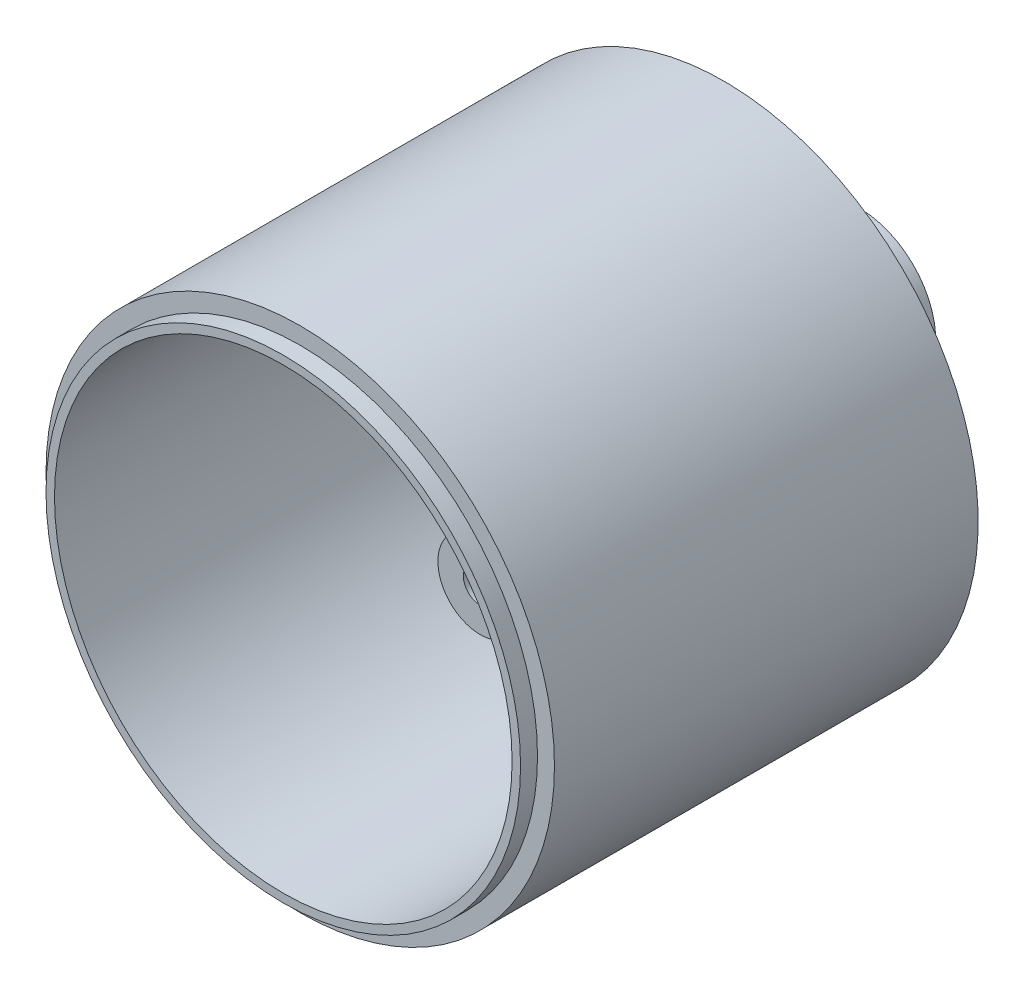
ISO-10303-21;
HEADER;
FILE_DESCRIPTION(('STEP AP214'),'2;1');
FILE_NAME('part.step','',(''),(''),'','','');
FILE_SCHEMA(('AUTOMOTIVE_DESIGN { 1 0 10303 214 1 1 1 1 }'));
ENDSEC;
DATA;
#1=APPLICATION_CONTEXT('core data for automotive mechanical design processes');
#2=APPLICATION_PROTOCOL_DEFINITION('international standard','automotive_design',2000,#1);
#3=PRODUCT_CONTEXT('',#1,'mechanical');
#4=PRODUCT('Part','Part','',(#3));
#5=PRODUCT_RELATED_PRODUCT_CATEGORY('part','',(#4));
#6=PRODUCT_DEFINITION_FORMATION('','',#4);
#7=PRODUCT_DEFINITION_CONTEXT('part definition',#1,'design');
#8=PRODUCT_DEFINITION('design','',#6,#7);
#9=PRODUCT_DEFINITION_SHAPE('','',#8);
#10=(LENGTH_UNIT() NAMED_UNIT(*) SI_UNIT(.MILLI.,.METRE.));
#11=(NAMED_UNIT(*) PLANE_ANGLE_UNIT() SI_UNIT($,.RADIAN.));
#12=(NAMED_UNIT(*) SI_UNIT($,.STERADIAN.) SOLID_ANGLE_UNIT());
#13=UNCERTAINTY_MEASURE_WITH_UNIT(LENGTH_MEASURE(1.E-05),#10,'distance_accuracy_value','');
#14=(GEOMETRIC_REPRESENTATION_CONTEXT(3) GLOBAL_UNCERTAINTY_ASSIGNED_CONTEXT((#13)) GLOBAL_UNIT_ASSIGNED_CONTEXT((#10,
#11,#12)) REPRESENTATION_CONTEXT('',''));
#15=CARTESIAN_POINT('',(0.,0.,0.));
#16=DIRECTION('',(0.,0.,1.));
#17=DIRECTION('',(1.,0.,0.));
#18=AXIS2_PLACEMENT_3D('',#15,#16,#17);
#19=CARTESIAN_POINT('',(-3.375,-6.97652313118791,-11.25));
#20=DIRECTION('',(0.,0.,1.));
#21=DIRECTION('',(1.,0.,0.));
#22=AXIS2_PLACEMENT_3D('',#19,#20,#21);
#23=PLANE('',#22);
#24=CARTESIAN_POINT('',(-3.375,-6.97652313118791,-11.25));
#25=DIRECTION('',(0.,0.,1.));
#26=DIRECTION('',(1.,0.,0.));
#27=AXIS2_PLACEMENT_3D('',#24,#25,#26);
#28=CIRCLE('',#27,1.);
#29=CARTESIAN_POINT('',(-2.375,-6.97652313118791,-11.25));
#30=VERTEX_POINT('',#29);
#31=EDGE_CURVE('E117',#30,#30,#28,.T.);
#32=ORIENTED_EDGE('',*,*,#31,.F.);
#33=EDGE_LOOP('',(#32));
#34=FACE_BOUND('',#33,.T.);
#35=CARTESIAN_POINT('',(-3.375,-6.97652313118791,-11.25));
#36=DIRECTION('',(0.,0.,1.));
#37=DIRECTION('',(1.,0.,0.));
#38=AXIS2_PLACEMENT_3D('',#35,#36,#37);
#39=CIRCLE('',#38,2.5);
#40=CARTESIAN_POINT('',(-3.9253017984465,-4.53784153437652,-11.25));
#41=VERTEX_POINT('',#40);
#42=CARTESIAN_POINT('',(-1.12139435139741,-5.89427473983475,-11.25));
#43=VERTEX_POINT('',#42);
#44=EDGE_CURVE('E85',#41,#43,#39,.T.);
#45=ORIENTED_EDGE('',*,*,#44,.T.);
#46=CARTESIAN_POINT('',(0.,0.,-11.25));
#47=DIRECTION('',(0.,0.,1.));
#48=DIRECTION('',(1.,0.,0.));
#49=AXIS2_PLACEMENT_3D('',#46,#47,#48);
#50=CIRCLE('',#49,6.);
#51=EDGE_CURVE('E86',#43,#41,#50,.F.);
#52=ORIENTED_EDGE('',*,*,#51,.T.);
#53=EDGE_LOOP('',(#45,#52));
#54=FACE_BOUND('',#53,.T.);
#55=ADVANCED_FACE('F33',(#34,#54),#23,.T.);
#56=CARTESIAN_POINT('',(-3.375,-6.97652313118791,-11.25));
#57=DIRECTION('',(0.,0.,-1.));
#58=DIRECTION('',(-1.,0.,0.));
#59=AXIS2_PLACEMENT_3D('',#56,#57,#58);
#60=CYLINDRICAL_SURFACE('',#59,2.5);
#61=DIRECTION('',(0.,0.,-1.));
#62=VECTOR('',#61,1.);
#63=CARTESIAN_POINT('',(-1.12139435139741,-5.89427473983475,-8.5));
#64=LINE('',#63,#62);
#65=CARTESIAN_POINT('',(-1.12139435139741,-5.89427473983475,-20.75));
#66=VERTEX_POINT('',#65);
#67=EDGE_CURVE('E76',#43,#66,#64,.T.);
#68=ORIENTED_EDGE('',*,*,#67,.F.);
#69=ORIENTED_EDGE('',*,*,#44,.F.);
#70=DIRECTION('',(0.,0.,-1.));
#71=VECTOR('',#70,1.);
#72=CARTESIAN_POINT('',(-3.9253017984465,-4.53784153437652,-8.5));
#73=LINE('',#72,#71);
#74=CARTESIAN_POINT('',(-3.9253017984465,-4.53784153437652,-20.75));
#75=VERTEX_POINT('',#74);
#76=EDGE_CURVE('E73',#75,#41,#73,.F.);
#77=ORIENTED_EDGE('',*,*,#76,.F.);
#78=CARTESIAN_POINT('',(-3.375,-6.97652313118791,-20.75));
#79=DIRECTION('',(0.,0.,-1.));
#80=DIRECTION('',(-1.,0.,0.));
#81=AXIS2_PLACEMENT_3D('',#78,#79,#80);
#82=CIRCLE('',#81,2.5);
#83=EDGE_CURVE('E83',#75,#66,#82,.F.);
#84=ORIENTED_EDGE('',*,*,#83,.T.);
#85=EDGE_LOOP('',(#68,#69,#77,#84));
#86=FACE_BOUND('',#85,.T.);
#87=ADVANCED_FACE('F82',(#86),#60,.T.);
#88=CARTESIAN_POINT('',(3.36921506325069,-7.25592102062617,-17.75));
#89=DIRECTION('',(0.,0.,1.));
#90=DIRECTION('',(1.,0.,0.));
#91=AXIS2_PLACEMENT_3D('',#88,#89,#90);
#92=PLANE('',#91);
#93=CARTESIAN_POINT('',(3.36921506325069,-7.25592102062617,-17.75));
#94=DIRECTION('',(0.,0.,1.));
#95=DIRECTION('',(1.,0.,0.));
#96=AXIS2_PLACEMENT_3D('',#93,#94,#95);
#97=CIRCLE('',#96,1.);
#98=CARTESIAN_POINT('',(4.36921506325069,-7.25592102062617,-17.75));
#99=VERTEX_POINT('',#98);
#100=EDGE_CURVE('E114',#99,#99,#97,.T.);
#101=ORIENTED_EDGE('',*,*,#100,.F.);
#102=EDGE_LOOP('',(#101));
#103=FACE_BOUND('',#102,.T.);
#104=CARTESIAN_POINT('',(3.36921506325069,-7.25592102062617,-17.75));
#105=DIRECTION('',(0.,0.,1.));
#106=DIRECTION('',(1.,0.,0.));
#107=AXIS2_PLACEMENT_3D('',#104,#105,#106);
#108=CIRCLE('',#107,2.5);
#109=CARTESIAN_POINT('',(1.29639602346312,-5.85827255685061,-17.75));
#110=VERTEX_POINT('',#109);
#111=CARTESIAN_POINT('',(3.6389776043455,-4.77051800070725,-17.75));
#112=VERTEX_POINT('',#111);
#113=EDGE_CURVE('E110',#110,#112,#108,.T.);
#114=ORIENTED_EDGE('',*,*,#113,.T.);
#115=CARTESIAN_POINT('',(0.,0.,-17.75));
#116=DIRECTION('',(0.,0.,1.));
#117=DIRECTION('',(1.,0.,0.));
#118=AXIS2_PLACEMENT_3D('',#115,#116,#117);
#119=CIRCLE('',#118,6.);
#120=EDGE_CURVE('E78',#112,#110,#119,.F.);
#121=ORIENTED_EDGE('',*,*,#120,.T.);
#122=EDGE_LOOP('',(#114,#121));
#123=FACE_BOUND('',#122,.T.);
#124=ADVANCED_FACE('F109',(#103,#123),#92,.T.);
#125=CARTESIAN_POINT('',(3.36921506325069,-7.25592102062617,-17.75));
#126=DIRECTION('',(0.,0.,-1.));
#127=DIRECTION('',(-1.,0.,0.));
#128=AXIS2_PLACEMENT_3D('',#125,#126,#127);
#129=CYLINDRICAL_SURFACE('',#128,2.5);
#130=DIRECTION('',(0.,0.,-1.));
#131=VECTOR('',#130,1.);
#132=CARTESIAN_POINT('',(3.6389776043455,-4.77051800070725,-8.5));
#133=LINE('',#132,#131);
#134=CARTESIAN_POINT('',(3.6389776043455,-4.77051800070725,-20.75));
#135=VERTEX_POINT('',#134);
#136=EDGE_CURVE('E11',#112,#135,#133,.T.);
#137=ORIENTED_EDGE('',*,*,#136,.F.);
#138=ORIENTED_EDGE('',*,*,#113,.F.);
#139=DIRECTION('',(0.,0.,-1.));
#140=VECTOR('',#139,1.);
#141=CARTESIAN_POINT('',(1.29639602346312,-5.85827255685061,-8.5));
#142=LINE('',#141,#140);
#143=CARTESIAN_POINT('',(1.29639602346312,-5.85827255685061,-20.75));
#144=VERTEX_POINT('',#143);
#145=EDGE_CURVE('E41',#144,#110,#142,.F.);
#146=ORIENTED_EDGE('',*,*,#145,.F.);
#147=CARTESIAN_POINT('',(3.36921506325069,-7.25592102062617,-20.75));
#148=DIRECTION('',(0.,0.,-1.));
#149=DIRECTION('',(-1.,0.,0.));
#150=AXIS2_PLACEMENT_3D('',#147,#148,#149);
#151=CIRCLE('',#150,2.5);
#152=EDGE_CURVE('E90',#144,#135,#151,.F.);
#153=ORIENTED_EDGE('',*,*,#152,.T.);
#154=EDGE_LOOP('',(#137,#138,#146,#153));
#155=FACE_BOUND('',#154,.T.);
#156=ADVANCED_FACE('F112',(#155),#129,.T.);
#157=CARTESIAN_POINT('',(0.,0.,2.75));
#158=DIRECTION('',(0.,0.,1.));
#159=DIRECTION('',(1.,0.,0.));
#160=AXIS2_PLACEMENT_3D('',#157,#158,#159);
#161=PLANE('',#160);
#162=CARTESIAN_POINT('',(0.,0.,2.75));
#163=DIRECTION('',(0.,0.,1.));
#164=DIRECTION('',(1.,0.,0.));
#165=AXIS2_PLACEMENT_3D('',#162,#163,#164);
#166=CIRCLE('',#165,15.);
#167=CARTESIAN_POINT('',(15.,0.,2.75));
#168=VERTEX_POINT('',#167);
#169=EDGE_CURVE('E91',#168,#168,#166,.T.);
#170=ORIENTED_EDGE('',*,*,#169,.T.);
#171=EDGE_LOOP('',(#170));
#172=FACE_BOUND('',#171,.T.);
#173=CARTESIAN_POINT('',(0.,0.,2.75));
#174=DIRECTION('',(0.,0.,1.));
#175=DIRECTION('',(1.,0.,0.));
#176=AXIS2_PLACEMENT_3D('',#173,#174,#175);
#177=CIRCLE('',#176,14.);
#178=CARTESIAN_POINT('',(14.,0.,2.75));
#179=VERTEX_POINT('',#178);
#180=EDGE_CURVE('E238',#179,#179,#177,.T.);
#181=ORIENTED_EDGE('',*,*,#180,.F.);
#182=EDGE_LOOP('',(#181));
#183=FACE_BOUND('',#182,.T.);
#184=ADVANCED_FACE('F228',(#172,#183),#161,.T.);
#185=CARTESIAN_POINT('',(0.,0.,-20.75));
#186=DIRECTION('',(0.,0.,-1.));
#187=DIRECTION('',(-1.,0.,0.));
#188=AXIS2_PLACEMENT_3D('',#185,#186,#187);
#189=PLANE('',#188);
#190=ORIENTED_EDGE('',*,*,#152,.F.);
#191=CARTESIAN_POINT('',(0.,0.,-20.75));
#192=DIRECTION('',(0.,0.,1.));
#193=DIRECTION('',(1.,0.,0.));
#194=AXIS2_PLACEMENT_3D('',#191,#192,#193);
#195=CIRCLE('',#194,6.);
#196=EDGE_CURVE('E54',#144,#135,#195,.T.);
#197=ORIENTED_EDGE('',*,*,#196,.T.);
#198=EDGE_LOOP('',(#190,#197));
#199=FACE_BOUND('',#198,.T.);
#200=CARTESIAN_POINT('',(0.,0.,-20.75));
#201=DIRECTION('',(0.,0.,-1.));
#202=DIRECTION('',(-1.,0.,0.));
#203=AXIS2_PLACEMENT_3D('',#200,#201,#202);
#204=CIRCLE('',#203,3.5);
#205=CARTESIAN_POINT('',(-3.5,0.,-20.75));
#206=VERTEX_POINT('',#205);
#207=EDGE_CURVE('E134',#206,#206,#204,.T.);
#208=ORIENTED_EDGE('',*,*,#207,.T.);
#209=EDGE_LOOP('',(#208));
#210=FACE_BOUND('',#209,.T.);
#211=EDGE_CURVE('E47',#75,#66,#195,.T.);
#212=ORIENTED_EDGE('',*,*,#211,.T.);
#213=ORIENTED_EDGE('',*,*,#83,.F.);
#214=EDGE_LOOP('',(#212,#213));
#215=FACE_BOUND('',#214,.T.);
#216=CARTESIAN_POINT('',(0.,0.,-20.75));
#217=DIRECTION('',(0.,0.,-1.));
#218=DIRECTION('',(-1.,0.,0.));
#219=AXIS2_PLACEMENT_3D('',#216,#217,#218);
#220=CIRCLE('',#219,13.5);
#221=CARTESIAN_POINT('',(-13.5,0.,-20.75));
#222=VERTEX_POINT('',#221);
#223=EDGE_CURVE('E133',#222,#222,#220,.T.);
#224=ORIENTED_EDGE('',*,*,#223,.F.);
#225=EDGE_LOOP('',(#224));
#226=FACE_BOUND('',#225,.T.);
#227=ADVANCED_FACE('F88',(#199,#210,#215,#226),#189,.F.);
#228=CARTESIAN_POINT('',(0.,0.,-24.25));
#229=DIRECTION('',(0.,0.,-1.));
#230=DIRECTION('',(-1.,0.,0.));
#231=AXIS2_PLACEMENT_3D('',#228,#229,#230);
#232=PLANE('',#231);
#233=CARTESIAN_POINT('',(0.,0.,-24.25));
#234=DIRECTION('',(0.,0.,-1.));
#235=DIRECTION('',(-1.,0.,0.));
#236=AXIS2_PLACEMENT_3D('',#233,#234,#235);
#237=CIRCLE('',#236,5.);
#238=CARTESIAN_POINT('',(-5.,0.,-24.25));
#239=VERTEX_POINT('',#238);
#240=EDGE_CURVE('E154',#239,#239,#237,.T.);
#241=ORIENTED_EDGE('',*,*,#240,.T.);
#242=EDGE_LOOP('',(#241));
#243=FACE_BOUND('',#242,.T.);
#244=CARTESIAN_POINT('',(0.,0.,-24.25));
#245=DIRECTION('',(0.,0.,-1.));
#246=DIRECTION('',(-1.,0.,0.));
#247=AXIS2_PLACEMENT_3D('',#244,#245,#246);
#248=CIRCLE('',#247,4.5);
#249=CARTESIAN_POINT('',(-4.5,0.,-24.25));
#250=VERTEX_POINT('',#249);
#251=EDGE_CURVE('E143',#250,#250,#248,.T.);
#252=ORIENTED_EDGE('',*,*,#251,.F.);
#253=EDGE_LOOP('',(#252));
#254=FACE_BOUND('',#253,.T.);
#255=ADVANCED_FACE('F173',(#243,#254),#232,.T.);
#256=CARTESIAN_POINT('',(0.,0.,-22.25));
#257=DIRECTION('',(0.,0.,-1.));
#258=DIRECTION('',(-1.,0.,0.));
#259=AXIS2_PLACEMENT_3D('',#256,#257,#258);
#260=PLANE('',#259);
#261=CARTESIAN_POINT('',(0.,0.,-22.25));
#262=DIRECTION('',(0.,0.,-1.));
#263=DIRECTION('',(-1.,0.,0.));
#264=AXIS2_PLACEMENT_3D('',#261,#262,#263);
#265=CIRCLE('',#264,15.);
#266=CARTESIAN_POINT('',(-15.,0.,-22.25));
#267=VERTEX_POINT('',#266);
#268=EDGE_CURVE('E96',#267,#267,#265,.T.);
#269=ORIENTED_EDGE('',*,*,#268,.T.);
#270=EDGE_LOOP('',(#269));
#271=FACE_BOUND('',#270,.T.);
#272=CARTESIAN_POINT('',(0.,0.,-22.25));
#273=DIRECTION('',(0.,0.,-1.));
#274=DIRECTION('',(-1.,0.,0.));
#275=AXIS2_PLACEMENT_3D('',#272,#273,#274);
#276=CIRCLE('',#275,5.);
#277=CARTESIAN_POINT('',(-5.,0.,-22.25));
#278=VERTEX_POINT('',#277);
#279=EDGE_CURVE('E151',#278,#278,#276,.T.);
#280=ORIENTED_EDGE('',*,*,#279,.F.);
#281=EDGE_LOOP('',(#280));
#282=FACE_BOUND('',#281,.T.);
#283=ADVANCED_FACE('F160',(#271,#282),#260,.T.);
#284=CARTESIAN_POINT('',(0.,0.,2.75));
#285=DIRECTION('',(0.,0.,-1.));
#286=DIRECTION('',(-1.,0.,0.));
#287=AXIS2_PLACEMENT_3D('',#284,#285,#286);
#288=CYLINDRICAL_SURFACE('',#287,15.);
#289=ORIENTED_EDGE('',*,*,#169,.F.);
#290=EDGE_LOOP('',(#289));
#291=FACE_BOUND('',#290,.T.);
#292=ORIENTED_EDGE('',*,*,#268,.F.);
#293=EDGE_LOOP('',(#292));
#294=FACE_BOUND('',#293,.T.);
#295=ADVANCED_FACE('F35',(#291,#294),#288,.T.);
#296=CARTESIAN_POINT('',(0.,0.,-24.25));
#297=DIRECTION('',(0.,0.,1.));
#298=DIRECTION('',(1.,0.,0.));
#299=AXIS2_PLACEMENT_3D('',#296,#297,#298);
#300=CYLINDRICAL_SURFACE('',#299,5.);
#301=ORIENTED_EDGE('',*,*,#240,.F.);
#302=EDGE_LOOP('',(#301));
#303=FACE_BOUND('',#302,.T.);
#304=ORIENTED_EDGE('',*,*,#279,.T.);
#305=EDGE_LOOP('',(#304));
#306=FACE_BOUND('',#305,.T.);
#307=ADVANCED_FACE('F164',(#303,#306),#300,.T.);
#308=CARTESIAN_POINT('',(0.,0.,-30.25));
#309=DIRECTION('',(0.,0.,1.));
#310=DIRECTION('',(1.,0.,0.));
#311=AXIS2_PLACEMENT_3D('',#308,#309,#310);
#312=CYLINDRICAL_SURFACE('',#311,4.5);
#313=CARTESIAN_POINT('',(0.,0.,-30.25));
#314=DIRECTION('',(0.,0.,-1.));
#315=DIRECTION('',(-1.,0.,0.));
#316=AXIS2_PLACEMENT_3D('',#313,#314,#315);
#317=CIRCLE('',#316,4.5);
#318=CARTESIAN_POINT('',(-4.5,0.,-30.25));
#319=VERTEX_POINT('',#318);
#320=EDGE_CURVE('E148',#319,#319,#317,.T.);
#321=ORIENTED_EDGE('',*,*,#320,.F.);
#322=EDGE_LOOP('',(#321));
#323=FACE_BOUND('',#322,.T.);
#324=ORIENTED_EDGE('',*,*,#251,.T.);
#325=EDGE_LOOP('',(#324));
#326=FACE_BOUND('',#325,.T.);
#327=ADVANCED_FACE('F170',(#323,#326),#312,.T.);
#328=CARTESIAN_POINT('',(0.,0.,-30.25));
#329=DIRECTION('',(0.,0.,-1.));
#330=DIRECTION('',(-1.,0.,0.));
#331=AXIS2_PLACEMENT_3D('',#328,#329,#330);
#332=PLANE('',#331);
#333=CARTESIAN_POINT('',(0.,0.,-30.25));
#334=DIRECTION('',(0.,0.,-1.));
#335=DIRECTION('',(-1.,0.,0.));
#336=AXIS2_PLACEMENT_3D('',#333,#334,#335);
#337=CIRCLE('',#336,2.);
#338=CARTESIAN_POINT('',(-2.,0.,-30.25));
#339=VERTEX_POINT('',#338);
#340=EDGE_CURVE('E127',#339,#339,#337,.T.);
#341=ORIENTED_EDGE('',*,*,#340,.F.);
#342=EDGE_LOOP('',(#341));
#343=FACE_BOUND('',#342,.T.);
#344=ORIENTED_EDGE('',*,*,#320,.T.);
#345=EDGE_LOOP('',(#344));
#346=FACE_BOUND('',#345,.T.);
#347=ADVANCED_FACE('F198',(#343,#346),#332,.T.);
#348=CARTESIAN_POINT('',(0.,0.,-22.75));
#349=DIRECTION('',(0.,0.,-1.));
#350=DIRECTION('',(-1.,0.,0.));
#351=AXIS2_PLACEMENT_3D('',#348,#349,#350);
#352=PLANE('',#351);
#353=CARTESIAN_POINT('',(0.,0.,-22.75));
#354=DIRECTION('',(0.,0.,-1.));
#355=DIRECTION('',(-1.,0.,0.));
#356=AXIS2_PLACEMENT_3D('',#353,#354,#355);
#357=CIRCLE('',#356,3.5);
#358=CARTESIAN_POINT('',(-3.5,0.,-22.75));
#359=VERTEX_POINT('',#358);
#360=EDGE_CURVE('E130',#359,#359,#357,.T.);
#361=ORIENTED_EDGE('',*,*,#360,.F.);
#362=EDGE_LOOP('',(#361));
#363=FACE_BOUND('',#362,.T.);
#364=CARTESIAN_POINT('',(0.,0.,-22.75));
#365=DIRECTION('',(0.,0.,-1.));
#366=DIRECTION('',(-1.,0.,0.));
#367=AXIS2_PLACEMENT_3D('',#364,#365,#366);
#368=CIRCLE('',#367,3.);
#369=CARTESIAN_POINT('',(-3.,0.,-22.75));
#370=VERTEX_POINT('',#369);
#371=EDGE_CURVE('E135',#370,#370,#368,.T.);
#372=ORIENTED_EDGE('',*,*,#371,.T.);
#373=EDGE_LOOP('',(#372));
#374=FACE_BOUND('',#373,.T.);
#375=ADVANCED_FACE('F194',(#363,#374),#352,.F.);
#376=CARTESIAN_POINT('',(0.,0.,2.75));
#377=DIRECTION('',(0.,0.,-1.));
#378=DIRECTION('',(-1.,0.,0.));
#379=AXIS2_PLACEMENT_3D('',#376,#377,#378);
#380=CYLINDRICAL_SURFACE('',#379,13.5);
#381=ORIENTED_EDGE('',*,*,#223,.T.);
#382=EDGE_LOOP('',(#381));
#383=FACE_BOUND('',#382,.T.);
#384=CARTESIAN_POINT('',(0.,0.,3.75));
#385=DIRECTION('',(0.,0.,1.));
#386=DIRECTION('',(1.,0.,0.));
#387=AXIS2_PLACEMENT_3D('',#384,#385,#386);
#388=CIRCLE('',#387,13.5);
#389=CARTESIAN_POINT('',(13.5,0.,3.75));
#390=VERTEX_POINT('',#389);
#391=EDGE_CURVE('E241',#390,#390,#388,.T.);
#392=ORIENTED_EDGE('',*,*,#391,.T.);
#393=EDGE_LOOP('',(#392));
#394=FACE_BOUND('',#393,.T.);
#395=ADVANCED_FACE('F197',(#383,#394),#380,.F.);
#396=CARTESIAN_POINT('',(0.,0.,-24.25));
#397=DIRECTION('',(0.,0.,1.));
#398=DIRECTION('',(1.,0.,0.));
#399=AXIS2_PLACEMENT_3D('',#396,#397,#398);
#400=CYLINDRICAL_SURFACE('',#399,3.5);
#401=ORIENTED_EDGE('',*,*,#360,.T.);
#402=EDGE_LOOP('',(#401));
#403=FACE_BOUND('',#402,.T.);
#404=ORIENTED_EDGE('',*,*,#207,.F.);
#405=EDGE_LOOP('',(#404));
#406=FACE_BOUND('',#405,.T.);
#407=ADVANCED_FACE('F208',(#403,#406),#400,.F.);
#408=CARTESIAN_POINT('',(0.,0.,-30.25));
#409=DIRECTION('',(0.,0.,1.));
#410=DIRECTION('',(1.,0.,0.));
#411=AXIS2_PLACEMENT_3D('',#408,#409,#410);
#412=CYLINDRICAL_SURFACE('',#411,3.);
#413=CARTESIAN_POINT('',(0.,0.,-28.75));
#414=DIRECTION('',(0.,0.,-1.));
#415=DIRECTION('',(-1.,0.,0.));
#416=AXIS2_PLACEMENT_3D('',#413,#414,#415);
#417=CIRCLE('',#416,3.);
#418=CARTESIAN_POINT('',(-3.,0.,-28.75));
#419=VERTEX_POINT('',#418);
#420=EDGE_CURVE('E138',#419,#419,#417,.T.);
#421=ORIENTED_EDGE('',*,*,#420,.T.);
#422=EDGE_LOOP('',(#421));
#423=FACE_BOUND('',#422,.T.);
#424=ORIENTED_EDGE('',*,*,#371,.F.);
#425=EDGE_LOOP('',(#424));
#426=FACE_BOUND('',#425,.T.);
#427=ADVANCED_FACE('F212',(#423,#426),#412,.F.);
#428=CARTESIAN_POINT('',(0.,0.,-28.75));
#429=DIRECTION('',(0.,0.,-1.));
#430=DIRECTION('',(-1.,0.,0.));
#431=AXIS2_PLACEMENT_3D('',#428,#429,#430);
#432=PLANE('',#431);
#433=CARTESIAN_POINT('',(0.,0.,-28.75));
#434=DIRECTION('',(0.,0.,-1.));
#435=DIRECTION('',(-1.,0.,0.));
#436=AXIS2_PLACEMENT_3D('',#433,#434,#435);
#437=CIRCLE('',#436,2.);
#438=CARTESIAN_POINT('',(-2.,0.,-28.75));
#439=VERTEX_POINT('',#438);
#440=EDGE_CURVE('E99',#439,#439,#437,.T.);
#441=ORIENTED_EDGE('',*,*,#440,.T.);
#442=EDGE_LOOP('',(#441));
#443=FACE_BOUND('',#442,.T.);
#444=ORIENTED_EDGE('',*,*,#420,.F.);
#445=EDGE_LOOP('',(#444));
#446=FACE_BOUND('',#445,.T.);
#447=ADVANCED_FACE('F192',(#443,#446),#432,.F.);
#448=CARTESIAN_POINT('',(0.,0.,2.75));
#449=DIRECTION('',(0.,0.,-1.));
#450=DIRECTION('',(-1.,0.,0.));
#451=AXIS2_PLACEMENT_3D('',#448,#449,#450);
#452=CYLINDRICAL_SURFACE('',#451,2.);
#453=ORIENTED_EDGE('',*,*,#340,.T.);
#454=EDGE_LOOP('',(#453));
#455=FACE_BOUND('',#454,.T.);
#456=ORIENTED_EDGE('',*,*,#440,.F.);
#457=EDGE_LOOP('',(#456));
#458=FACE_BOUND('',#457,.T.);
#459=ADVANCED_FACE('F189',(#455,#458),#452,.F.);
#460=CARTESIAN_POINT('',(-3.375,-6.97652313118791,-11.25));
#461=DIRECTION('',(0.,0.,-1.));
#462=DIRECTION('',(-1.,0.,0.));
#463=AXIS2_PLACEMENT_3D('',#460,#461,#462);
#464=CYLINDRICAL_SURFACE('',#463,1.);
#465=ORIENTED_EDGE('',*,*,#31,.T.);
#466=EDGE_LOOP('',(#465));
#467=FACE_BOUND('',#466,.T.);
#468=CARTESIAN_POINT('',(-3.375,-6.97652313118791,-20.75));
#469=DIRECTION('',(0.,0.,1.));
#470=DIRECTION('',(1.,0.,0.));
#471=AXIS2_PLACEMENT_3D('',#468,#469,#470);
#472=CIRCLE('',#471,1.);
#473=CARTESIAN_POINT('',(-2.375,-6.97652313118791,-20.75));
#474=VERTEX_POINT('',#473);
#475=EDGE_CURVE('E113',#474,#474,#472,.T.);
#476=ORIENTED_EDGE('',*,*,#475,.F.);
#477=EDGE_LOOP('',(#476));
#478=FACE_BOUND('',#477,.T.);
#479=ADVANCED_FACE('F186',(#467,#478),#464,.F.);
#480=ORIENTED_EDGE('',*,*,#475,.T.);
#481=EDGE_LOOP('',(#480));
#482=FACE_BOUND('',#481,.T.);
#483=ADVANCED_FACE('F200',(#482),#189,.F.);
#484=CARTESIAN_POINT('',(3.36921506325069,-7.25592102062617,-17.75));
#485=DIRECTION('',(0.,0.,-1.));
#486=DIRECTION('',(-1.,0.,0.));
#487=AXIS2_PLACEMENT_3D('',#484,#485,#486);
#488=CYLINDRICAL_SURFACE('',#487,1.);
#489=ORIENTED_EDGE('',*,*,#100,.T.);
#490=EDGE_LOOP('',(#489));
#491=FACE_BOUND('',#490,.T.);
#492=CARTESIAN_POINT('',(3.36921506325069,-7.25592102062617,-20.75));
#493=DIRECTION('',(0.,0.,1.));
#494=DIRECTION('',(1.,0.,0.));
#495=AXIS2_PLACEMENT_3D('',#492,#493,#494);
#496=CIRCLE('',#495,1.);
#497=CARTESIAN_POINT('',(4.36921506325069,-7.25592102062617,-20.75));
#498=VERTEX_POINT('',#497);
#499=EDGE_CURVE('E120',#498,#498,#496,.T.);
#500=ORIENTED_EDGE('',*,*,#499,.F.);
#501=EDGE_LOOP('',(#500));
#502=FACE_BOUND('',#501,.T.);
#503=ADVANCED_FACE('F203',(#491,#502),#488,.F.);
#504=ORIENTED_EDGE('',*,*,#499,.T.);
#505=EDGE_LOOP('',(#504));
#506=FACE_BOUND('',#505,.T.);
#507=ADVANCED_FACE('F205',(#506),#189,.F.);
#508=CARTESIAN_POINT('',(0.,0.,3.75));
#509=DIRECTION('',(0.,0.,1.));
#510=DIRECTION('',(1.,0.,0.));
#511=AXIS2_PLACEMENT_3D('',#508,#509,#510);
#512=PLANE('',#511);
#513=CARTESIAN_POINT('',(0.,0.,3.75));
#514=DIRECTION('',(0.,0.,1.));
#515=DIRECTION('',(1.,0.,0.));
#516=AXIS2_PLACEMENT_3D('',#513,#514,#515);
#517=CIRCLE('',#516,14.);
#518=CARTESIAN_POINT('',(14.,0.,3.75));
#519=VERTEX_POINT('',#518);
#520=EDGE_CURVE('E240',#519,#519,#517,.T.);
#521=ORIENTED_EDGE('',*,*,#520,.T.);
#522=EDGE_LOOP('',(#521));
#523=FACE_BOUND('',#522,.T.);
#524=ORIENTED_EDGE('',*,*,#391,.F.);
#525=EDGE_LOOP('',(#524));
#526=FACE_BOUND('',#525,.T.);
#527=ADVANCED_FACE('F258',(#523,#526),#512,.T.);
#528=CARTESIAN_POINT('',(0.,0.,3.75));
#529=DIRECTION('',(0.,0.,-1.));
#530=DIRECTION('',(-1.,0.,0.));
#531=AXIS2_PLACEMENT_3D('',#528,#529,#530);
#532=CYLINDRICAL_SURFACE('',#531,14.);
#533=ORIENTED_EDGE('',*,*,#520,.F.);
#534=EDGE_LOOP('',(#533));
#535=FACE_BOUND('',#534,.T.);
#536=ORIENTED_EDGE('',*,*,#180,.T.);
#537=EDGE_LOOP('',(#536));
#538=FACE_BOUND('',#537,.T.);
#539=ADVANCED_FACE('F261',(#535,#538),#532,.T.);
#540=CARTESIAN_POINT('',(0.,0.,3.75));
#541=DIRECTION('',(0.,0.,-1.));
#542=DIRECTION('',(-1.,0.,0.));
#543=AXIS2_PLACEMENT_3D('',#540,#541,#542);
#544=CYLINDRICAL_SURFACE('',#543,6.);
#545=ORIENTED_EDGE('',*,*,#136,.T.);
#546=ORIENTED_EDGE('',*,*,#196,.F.);
#547=ORIENTED_EDGE('',*,*,#145,.T.);
#548=ORIENTED_EDGE('',*,*,#120,.F.);
#549=EDGE_LOOP('',(#545,#546,#547,#548));
#550=FACE_BOUND('',#549,.T.);
#551=ADVANCED_FACE('F103',(#550),#544,.F.);
#552=ORIENTED_EDGE('',*,*,#67,.T.);
#553=ORIENTED_EDGE('',*,*,#211,.F.);
#554=ORIENTED_EDGE('',*,*,#76,.T.);
#555=ORIENTED_EDGE('',*,*,#51,.F.);
#556=EDGE_LOOP('',(#552,#553,#554,#555));
#557=FACE_BOUND('',#556,.T.);
#558=ADVANCED_FACE('F72',(#557),#544,.F.);
#559=CLOSED_SHELL('',(#55,#87,#124,#156,#184,#227,#255,#283,#295,#307,#327,#347,#375,#395,#407,
#427,#447,#459,#479,#483,#503,#507,#527,#539,#551,#558));
#560=MANIFOLD_SOLID_BREP('B2',#559);
#561=ADVANCED_BREP_SHAPE_REPRESENTATION('',(#18,#560),#14);
#562=SHAPE_DEFINITION_REPRESENTATION(#9,#561);
ENDSEC;
END-ISO-10303-21;
